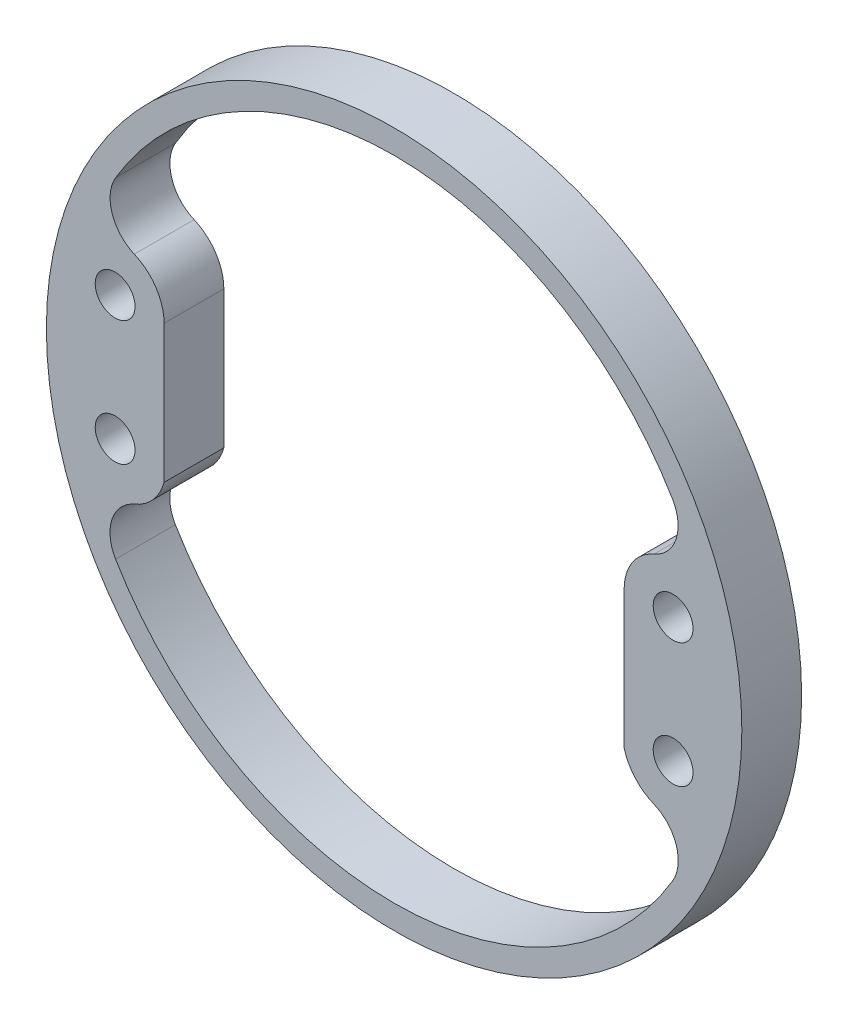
ISO-10303-21;
HEADER;
FILE_DESCRIPTION(('STEP AP214'),'2;1');
FILE_NAME('part.step','',(''),(''),'','','');
FILE_SCHEMA(('AUTOMOTIVE_DESIGN { 1 0 10303 214 1 1 1 1 }'));
ENDSEC;
DATA;
#1=APPLICATION_CONTEXT('core data for automotive mechanical design processes');
#2=APPLICATION_PROTOCOL_DEFINITION('international standard','automotive_design',2000,#1);
#3=PRODUCT_CONTEXT('',#1,'mechanical');
#4=PRODUCT('Part','Part','',(#3));
#5=PRODUCT_RELATED_PRODUCT_CATEGORY('part','',(#4));
#6=PRODUCT_DEFINITION_FORMATION('','',#4);
#7=PRODUCT_DEFINITION_CONTEXT('part definition',#1,'design');
#8=PRODUCT_DEFINITION('design','',#6,#7);
#9=PRODUCT_DEFINITION_SHAPE('','',#8);
#10=(LENGTH_UNIT() NAMED_UNIT(*) SI_UNIT(.MILLI.,.METRE.));
#11=(NAMED_UNIT(*) PLANE_ANGLE_UNIT() SI_UNIT($,.RADIAN.));
#12=(NAMED_UNIT(*) SI_UNIT($,.STERADIAN.) SOLID_ANGLE_UNIT());
#13=UNCERTAINTY_MEASURE_WITH_UNIT(LENGTH_MEASURE(1.E-05),#10,'distance_accuracy_value','');
#14=(GEOMETRIC_REPRESENTATION_CONTEXT(3) GLOBAL_UNCERTAINTY_ASSIGNED_CONTEXT((#13)) GLOBAL_UNIT_ASSIGNED_CONTEXT((#10,
#11,#12)) REPRESENTATION_CONTEXT('',''));
#15=CARTESIAN_POINT('',(0.,0.,0.));
#16=DIRECTION('',(0.,0.,1.));
#17=DIRECTION('',(1.,0.,0.));
#18=AXIS2_PLACEMENT_3D('',#15,#16,#17);
#19=CARTESIAN_POINT('',(0.,0.,3.81));
#20=DIRECTION('',(0.,0.,-1.));
#21=DIRECTION('',(-1.,0.,0.));
#22=AXIS2_PLACEMENT_3D('',#19,#20,#21);
#23=CYLINDRICAL_SURFACE('',#22,20.6375);
#24=CARTESIAN_POINT('',(0.,0.,3.81));
#25=DIRECTION('',(0.,0.,1.));
#26=DIRECTION('',(1.,0.,0.));
#27=AXIS2_PLACEMENT_3D('',#24,#25,#26);
#28=CIRCLE('',#27,20.6375);
#29=CARTESIAN_POINT('',(-17.7509733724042,-10.5266020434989,3.81));
#30=VERTEX_POINT('',#29);
#31=CARTESIAN_POINT('',(17.7509733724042,-10.5266020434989,3.81));
#32=VERTEX_POINT('',#31);
#33=EDGE_CURVE('E173',#30,#32,#28,.T.);
#34=ORIENTED_EDGE('',*,*,#33,.T.);
#35=DIRECTION('',(0.,0.,-1.));
#36=VECTOR('',#35,1.);
#37=CARTESIAN_POINT('',(17.7509733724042,-10.5266020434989,3.81));
#38=LINE('',#37,#36);
#39=CARTESIAN_POINT('',(17.7509733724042,-10.5266020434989,0.));
#40=VERTEX_POINT('',#39);
#41=EDGE_CURVE('E219',#32,#40,#38,.T.);
#42=ORIENTED_EDGE('',*,*,#41,.T.);
#43=CARTESIAN_POINT('',(0.,0.,0.));
#44=DIRECTION('',(0.,0.,1.));
#45=DIRECTION('',(1.,0.,0.));
#46=AXIS2_PLACEMENT_3D('',#43,#44,#45);
#47=CIRCLE('',#46,20.6375);
#48=CARTESIAN_POINT('',(-17.7509733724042,-10.5266020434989,0.));
#49=VERTEX_POINT('',#48);
#50=EDGE_CURVE('E129',#49,#40,#47,.T.);
#51=ORIENTED_EDGE('',*,*,#50,.F.);
#52=DIRECTION('',(0.,0.,-1.));
#53=VECTOR('',#52,1.);
#54=CARTESIAN_POINT('',(-17.7509733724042,-10.5266020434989,3.81));
#55=LINE('',#54,#53);
#56=EDGE_CURVE('E217',#49,#30,#55,.F.);
#57=ORIENTED_EDGE('',*,*,#56,.T.);
#58=EDGE_LOOP('',(#34,#42,#51,#57));
#59=FACE_BOUND('',#58,.T.);
#60=ADVANCED_FACE('F31',(#59),#23,.F.);
#61=CARTESIAN_POINT('',(-17.78,-3.90147909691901,3.81));
#62=DIRECTION('',(0.,0.,-1.));
#63=DIRECTION('',(-1.,0.,0.));
#64=AXIS2_PLACEMENT_3D('',#61,#62,#63);
#65=CYLINDRICAL_SURFACE('',#64,3.23102679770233);
#66=CARTESIAN_POINT('',(-17.78,-3.90147909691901,3.81));
#67=DIRECTION('',(0.,0.,1.));
#68=DIRECTION('',(1.,0.,0.));
#69=AXIS2_PLACEMENT_3D('',#66,#67,#68);
#70=CIRCLE('',#69,3.23102679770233);
#71=CARTESIAN_POINT('',(-16.5405803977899,-6.88533117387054,3.81));
#72=VERTEX_POINT('',#71);
#73=CARTESIAN_POINT('',(-14.6605823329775,-4.74336245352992,3.81));
#74=VERTEX_POINT('',#73);
#75=EDGE_CURVE('E176',#72,#74,#70,.T.);
#76=ORIENTED_EDGE('',*,*,#75,.F.);
#77=DIRECTION('',(0.,0.,-1.));
#78=VECTOR('',#77,1.);
#79=CARTESIAN_POINT('',(-16.5405803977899,-6.88533117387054,3.81));
#80=LINE('',#79,#78);
#81=CARTESIAN_POINT('',(-16.5405803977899,-6.88533117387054,0.));
#82=VERTEX_POINT('',#81);
#83=EDGE_CURVE('E126',#72,#82,#80,.T.);
#84=ORIENTED_EDGE('',*,*,#83,.T.);
#85=CARTESIAN_POINT('',(-17.78,-3.90147909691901,0.));
#86=DIRECTION('',(0.,0.,1.));
#87=DIRECTION('',(1.,0.,0.));
#88=AXIS2_PLACEMENT_3D('',#85,#86,#87);
#89=CIRCLE('',#88,3.23102679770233);
#90=CARTESIAN_POINT('',(-14.6605823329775,-4.74336245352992,0.));
#91=VERTEX_POINT('',#90);
#92=EDGE_CURVE('E119',#82,#91,#89,.T.);
#93=ORIENTED_EDGE('',*,*,#92,.T.);
#94=DIRECTION('',(0.,0.,-1.));
#95=VECTOR('',#94,1.);
#96=CARTESIAN_POINT('',(-14.6605823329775,-4.74336245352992,3.81));
#97=LINE('',#96,#95);
#98=EDGE_CURVE('E123',#74,#91,#97,.T.);
#99=ORIENTED_EDGE('',*,*,#98,.F.);
#100=EDGE_LOOP('',(#76,#84,#93,#99));
#101=FACE_BOUND('',#100,.T.);
#102=ADVANCED_FACE('F122',(#101),#65,.T.);
#103=CARTESIAN_POINT('',(-14.6605823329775,-48.8967213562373,3.81));
#104=DIRECTION('',(1.,0.,0.));
#105=DIRECTION('',(0.,1.,0.));
#106=AXIS2_PLACEMENT_3D('',#103,#104,#105);
#107=PLANE('',#106);
#108=DIRECTION('',(0.,-1.,0.));
#109=VECTOR('',#108,1.);
#110=CARTESIAN_POINT('',(-14.6605823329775,-48.8967213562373,0.));
#111=LINE('',#110,#109);
#112=CARTESIAN_POINT('',(-14.6605823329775,4.03602090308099,0.));
#113=VERTEX_POINT('',#112);
#114=EDGE_CURVE('E128',#113,#91,#111,.T.);
#115=ORIENTED_EDGE('',*,*,#114,.F.);
#116=DIRECTION('',(0.,0.,-1.));
#117=VECTOR('',#116,1.);
#118=CARTESIAN_POINT('',(-14.6605823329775,4.03602090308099,3.81));
#119=LINE('',#118,#117);
#120=CARTESIAN_POINT('',(-14.6605823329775,4.03602090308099,3.81));
#121=VERTEX_POINT('',#120);
#122=EDGE_CURVE('E138',#121,#113,#119,.T.);
#123=ORIENTED_EDGE('',*,*,#122,.F.);
#124=DIRECTION('',(0.,-1.,0.));
#125=VECTOR('',#124,1.);
#126=CARTESIAN_POINT('',(-14.6605823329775,-48.8967213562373,3.81));
#127=LINE('',#126,#125);
#128=EDGE_CURVE('E136',#121,#74,#127,.T.);
#129=ORIENTED_EDGE('',*,*,#128,.T.);
#130=ORIENTED_EDGE('',*,*,#98,.T.);
#131=EDGE_LOOP('',(#115,#123,#129,#130));
#132=FACE_BOUND('',#131,.T.);
#133=ADVANCED_FACE('F133',(#132),#107,.T.);
#134=CARTESIAN_POINT('',(-17.78,4.03602090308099,3.81));
#135=DIRECTION('',(0.,0.,-1.));
#136=DIRECTION('',(-1.,0.,0.));
#137=AXIS2_PLACEMENT_3D('',#134,#135,#136);
#138=CYLINDRICAL_SURFACE('',#137,3.1194176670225);
#139=CARTESIAN_POINT('',(-17.78,4.03602090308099,0.));
#140=DIRECTION('',(0.,0.,1.));
#141=DIRECTION('',(1.,0.,0.));
#142=AXIS2_PLACEMENT_3D('',#139,#140,#141);
#143=CIRCLE('',#142,3.1194176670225);
#144=CARTESIAN_POINT('',(-16.5562749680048,6.90538731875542,0.));
#145=VERTEX_POINT('',#144);
#146=EDGE_CURVE('E142',#145,#113,#143,.F.);
#147=ORIENTED_EDGE('',*,*,#146,.F.);
#148=DIRECTION('',(0.,0.,-1.));
#149=VECTOR('',#148,1.);
#150=CARTESIAN_POINT('',(-16.5562749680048,6.90538731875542,3.81));
#151=LINE('',#150,#149);
#152=CARTESIAN_POINT('',(-16.5562749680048,6.90538731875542,3.81));
#153=VERTEX_POINT('',#152);
#154=EDGE_CURVE('E46',#145,#153,#151,.F.);
#155=ORIENTED_EDGE('',*,*,#154,.T.);
#156=CARTESIAN_POINT('',(-17.78,4.03602090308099,3.81));
#157=DIRECTION('',(0.,0.,1.));
#158=DIRECTION('',(1.,0.,0.));
#159=AXIS2_PLACEMENT_3D('',#156,#157,#158);
#160=CIRCLE('',#159,3.1194176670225);
#161=EDGE_CURVE('E179',#153,#121,#160,.F.);
#162=ORIENTED_EDGE('',*,*,#161,.T.);
#163=ORIENTED_EDGE('',*,*,#122,.T.);
#164=EDGE_LOOP('',(#147,#155,#162,#163));
#165=FACE_BOUND('',#164,.T.);
#166=ADVANCED_FACE('F276',(#165),#138,.T.);
#167=CARTESIAN_POINT('',(0.,0.,3.81));
#168=DIRECTION('',(0.,0.,-1.));
#169=DIRECTION('',(-1.,0.,0.));
#170=AXIS2_PLACEMENT_3D('',#167,#168,#169);
#171=CYLINDRICAL_SURFACE('',#170,20.6375);
#172=CARTESIAN_POINT('',(0.,0.,0.));
#173=DIRECTION('',(0.,0.,1.));
#174=DIRECTION('',(1.,0.,0.));
#175=AXIS2_PLACEMENT_3D('',#172,#173,#174);
#176=CIRCLE('',#175,20.6375);
#177=CARTESIAN_POINT('',(-17.7436900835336,10.538874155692,0.));
#178=VERTEX_POINT('',#177);
#179=CARTESIAN_POINT('',(17.7436900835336,10.538874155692,0.));
#180=VERTEX_POINT('',#179);
#181=EDGE_CURVE('E145',#178,#180,#176,.F.);
#182=ORIENTED_EDGE('',*,*,#181,.T.);
#183=DIRECTION('',(0.,0.,-1.));
#184=VECTOR('',#183,1.);
#185=CARTESIAN_POINT('',(17.7436900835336,10.538874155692,3.81));
#186=LINE('',#185,#184);
#187=CARTESIAN_POINT('',(17.7436900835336,10.538874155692,3.81));
#188=VERTEX_POINT('',#187);
#189=EDGE_CURVE('E215',#180,#188,#186,.F.);
#190=ORIENTED_EDGE('',*,*,#189,.T.);
#191=CARTESIAN_POINT('',(0.,0.,3.81));
#192=DIRECTION('',(0.,0.,1.));
#193=DIRECTION('',(1.,0.,0.));
#194=AXIS2_PLACEMENT_3D('',#191,#192,#193);
#195=CIRCLE('',#194,20.6375);
#196=CARTESIAN_POINT('',(-17.7436900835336,10.538874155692,3.81));
#197=VERTEX_POINT('',#196);
#198=EDGE_CURVE('E181',#197,#188,#195,.F.);
#199=ORIENTED_EDGE('',*,*,#198,.F.);
#200=DIRECTION('',(0.,0.,-1.));
#201=VECTOR('',#200,1.);
#202=CARTESIAN_POINT('',(-17.7436900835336,10.538874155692,3.81));
#203=LINE('',#202,#201);
#204=EDGE_CURVE('E212',#197,#178,#203,.T.);
#205=ORIENTED_EDGE('',*,*,#204,.T.);
#206=EDGE_LOOP('',(#182,#190,#199,#205));
#207=FACE_BOUND('',#206,.T.);
#208=ADVANCED_FACE('F279',(#207),#171,.F.);
#209=CARTESIAN_POINT('',(17.78,4.03602090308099,3.81));
#210=DIRECTION('',(0.,0.,-1.));
#211=DIRECTION('',(-1.,0.,0.));
#212=AXIS2_PLACEMENT_3D('',#209,#210,#211);
#213=CYLINDRICAL_SURFACE('',#212,3.1194176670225);
#214=CARTESIAN_POINT('',(17.78,4.03602090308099,3.81));
#215=DIRECTION('',(0.,0.,1.));
#216=DIRECTION('',(1.,0.,0.));
#217=AXIS2_PLACEMENT_3D('',#214,#215,#216);
#218=CIRCLE('',#217,3.1194176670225);
#219=CARTESIAN_POINT('',(16.5562749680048,6.90538731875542,3.81));
#220=VERTEX_POINT('',#219);
#221=CARTESIAN_POINT('',(14.6605823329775,4.03602090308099,3.81));
#222=VERTEX_POINT('',#221);
#223=EDGE_CURVE('E184',#220,#222,#218,.T.);
#224=ORIENTED_EDGE('',*,*,#223,.F.);
#225=DIRECTION('',(0.,0.,-1.));
#226=VECTOR('',#225,1.);
#227=CARTESIAN_POINT('',(16.5562749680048,6.90538731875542,3.81));
#228=LINE('',#227,#226);
#229=CARTESIAN_POINT('',(16.5562749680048,6.90538731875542,0.));
#230=VERTEX_POINT('',#229);
#231=EDGE_CURVE('E137',#220,#230,#228,.T.);
#232=ORIENTED_EDGE('',*,*,#231,.T.);
#233=CARTESIAN_POINT('',(17.78,4.03602090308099,0.));
#234=DIRECTION('',(0.,0.,1.));
#235=DIRECTION('',(1.,0.,0.));
#236=AXIS2_PLACEMENT_3D('',#233,#234,#235);
#237=CIRCLE('',#236,3.1194176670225);
#238=CARTESIAN_POINT('',(14.6605823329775,4.03602090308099,0.));
#239=VERTEX_POINT('',#238);
#240=EDGE_CURVE('E151',#230,#239,#237,.T.);
#241=ORIENTED_EDGE('',*,*,#240,.T.);
#242=DIRECTION('',(0.,0.,-1.));
#243=VECTOR('',#242,1.);
#244=CARTESIAN_POINT('',(14.6605823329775,4.03602090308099,3.81));
#245=LINE('',#244,#243);
#246=EDGE_CURVE('E206',#222,#239,#245,.T.);
#247=ORIENTED_EDGE('',*,*,#246,.F.);
#248=EDGE_LOOP('',(#224,#232,#241,#247));
#249=FACE_BOUND('',#248,.T.);
#250=ADVANCED_FACE('F282',(#249),#213,.T.);
#251=CARTESIAN_POINT('',(14.6605823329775,-48.8967213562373,3.81));
#252=DIRECTION('',(1.,0.,0.));
#253=DIRECTION('',(0.,0.,-1.));
#254=AXIS2_PLACEMENT_3D('',#251,#252,#253);
#255=PLANE('',#254);
#256=DIRECTION('',(0.,-1.,0.));
#257=VECTOR('',#256,1.);
#258=CARTESIAN_POINT('',(14.6605823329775,-48.8967213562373,0.));
#259=LINE('',#258,#257);
#260=CARTESIAN_POINT('',(14.6605823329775,-4.74336245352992,0.));
#261=VERTEX_POINT('',#260);
#262=EDGE_CURVE('E153',#239,#261,#259,.T.);
#263=ORIENTED_EDGE('',*,*,#262,.T.);
#264=DIRECTION('',(0.,0.,-1.));
#265=VECTOR('',#264,1.);
#266=CARTESIAN_POINT('',(14.6605823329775,-4.74336245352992,3.81));
#267=LINE('',#266,#265);
#268=CARTESIAN_POINT('',(14.6605823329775,-4.74336245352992,3.81));
#269=VERTEX_POINT('',#268);
#270=EDGE_CURVE('E203',#269,#261,#267,.T.);
#271=ORIENTED_EDGE('',*,*,#270,.F.);
#272=DIRECTION('',(0.,-1.,0.));
#273=VECTOR('',#272,1.);
#274=CARTESIAN_POINT('',(14.6605823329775,-48.8967213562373,3.81));
#275=LINE('',#274,#273);
#276=EDGE_CURVE('E186',#222,#269,#275,.T.);
#277=ORIENTED_EDGE('',*,*,#276,.F.);
#278=ORIENTED_EDGE('',*,*,#246,.T.);
#279=EDGE_LOOP('',(#263,#271,#277,#278));
#280=FACE_BOUND('',#279,.T.);
#281=ADVANCED_FACE('F286',(#280),#255,.F.);
#282=CARTESIAN_POINT('',(0.,0.,3.81));
#283=DIRECTION('',(0.,0.,-1.));
#284=DIRECTION('',(-1.,0.,0.));
#285=AXIS2_PLACEMENT_3D('',#282,#283,#284);
#286=CYLINDRICAL_SURFACE('',#285,22.1615);
#287=CARTESIAN_POINT('',(0.,0.,3.81));
#288=DIRECTION('',(0.,0.,1.));
#289=DIRECTION('',(1.,0.,0.));
#290=AXIS2_PLACEMENT_3D('',#287,#288,#289);
#291=CIRCLE('',#290,22.1615);
#292=CARTESIAN_POINT('',(-22.1615,0.,3.81));
#293=VERTEX_POINT('',#292);
#294=EDGE_CURVE('E197',#293,#293,#291,.T.);
#295=CARTESIAN_POINT('',(0.,0.,0.));
#296=DIRECTION('',(0.,0.,1.));
#297=DIRECTION('',(1.,0.,0.));
#298=AXIS2_PLACEMENT_3D('',#295,#296,#297);
#299=CIRCLE('',#298,22.1615);
#300=CARTESIAN_POINT('',(-22.1615,0.,0.));
#301=VERTEX_POINT('',#300);
#302=EDGE_CURVE('E164',#301,#301,#299,.T.);
#303=CARTESIAN_POINT('',(-22.1615,0.,3.81));
#304=CARTESIAN_POINT('',(-22.1615,0.,3.7703125));
#305=CARTESIAN_POINT('',(-22.1615,0.,3.730625));
#306=CARTESIAN_POINT('',(-22.1615,0.,3.65125));
#307=CARTESIAN_POINT('',(-22.1615,0.,3.6115625));
#308=CARTESIAN_POINT('',(-22.1615,0.,3.5321875));
#309=CARTESIAN_POINT('',(-22.1615,0.,3.4925));
#310=CARTESIAN_POINT('',(-22.1615,0.,3.413125));
#311=CARTESIAN_POINT('',(-22.1615,0.,3.3734375));
#312=CARTESIAN_POINT('',(-22.1615,0.,3.2940625));
#313=CARTESIAN_POINT('',(-22.1615,0.,3.254375));
#314=CARTESIAN_POINT('',(-22.1615,0.,3.175));
#315=CARTESIAN_POINT('',(-22.1615,0.,3.1353125));
#316=CARTESIAN_POINT('',(-22.1615,0.,3.0559375));
#317=CARTESIAN_POINT('',(-22.1615,0.,3.01625));
#318=CARTESIAN_POINT('',(-22.1615,0.,2.936875));
#319=CARTESIAN_POINT('',(-22.1615,0.,2.8971875));
#320=CARTESIAN_POINT('',(-22.1615,0.,2.8178125));
#321=CARTESIAN_POINT('',(-22.1615,0.,2.778125));
#322=CARTESIAN_POINT('',(-22.1615,0.,2.69875));
#323=CARTESIAN_POINT('',(-22.1615,0.,2.6590625));
#324=CARTESIAN_POINT('',(-22.1615,0.,2.5796875));
#325=CARTESIAN_POINT('',(-22.1615,0.,2.54));
#326=CARTESIAN_POINT('',(-22.1615,0.,2.460625));
#327=CARTESIAN_POINT('',(-22.1615,0.,2.4209375));
#328=CARTESIAN_POINT('',(-22.1615,0.,2.3415625));
#329=CARTESIAN_POINT('',(-22.1615,0.,2.301875));
#330=CARTESIAN_POINT('',(-22.1615,0.,2.2225));
#331=CARTESIAN_POINT('',(-22.1615,0.,2.1828125));
#332=CARTESIAN_POINT('',(-22.1615,0.,2.1034375));
#333=CARTESIAN_POINT('',(-22.1615,0.,2.06375));
#334=CARTESIAN_POINT('',(-22.1615,0.,1.984375));
#335=CARTESIAN_POINT('',(-22.1615,0.,1.9446875));
#336=CARTESIAN_POINT('',(-22.1615,0.,1.8653125));
#337=CARTESIAN_POINT('',(-22.1615,0.,1.825625));
#338=CARTESIAN_POINT('',(-22.1615,0.,1.74625));
#339=CARTESIAN_POINT('',(-22.1615,0.,1.7065625));
#340=CARTESIAN_POINT('',(-22.1615,0.,1.6271875));
#341=CARTESIAN_POINT('',(-22.1615,0.,1.5875));
#342=CARTESIAN_POINT('',(-22.1615,0.,1.508125));
#343=CARTESIAN_POINT('',(-22.1615,0.,1.4684375));
#344=CARTESIAN_POINT('',(-22.1615,0.,1.3890625));
#345=CARTESIAN_POINT('',(-22.1615,0.,1.349375));
#346=CARTESIAN_POINT('',(-22.1615,0.,1.27));
#347=CARTESIAN_POINT('',(-22.1615,0.,1.2303125));
#348=CARTESIAN_POINT('',(-22.1615,0.,1.1509375));
#349=CARTESIAN_POINT('',(-22.1615,0.,1.11125));
#350=CARTESIAN_POINT('',(-22.1615,0.,1.031875));
#351=CARTESIAN_POINT('',(-22.1615,0.,0.9921875));
#352=CARTESIAN_POINT('',(-22.1615,0.,0.9128125));
#353=CARTESIAN_POINT('',(-22.1615,0.,0.873125));
#354=CARTESIAN_POINT('',(-22.1615,0.,0.79375));
#355=CARTESIAN_POINT('',(-22.1615,0.,0.7540625));
#356=CARTESIAN_POINT('',(-22.1615,0.,0.6746875));
#357=CARTESIAN_POINT('',(-22.1615,0.,0.635));
#358=CARTESIAN_POINT('',(-22.1615,0.,0.555625));
#359=CARTESIAN_POINT('',(-22.1615,0.,0.5159375));
#360=CARTESIAN_POINT('',(-22.1615,0.,0.4365625));
#361=CARTESIAN_POINT('',(-22.1615,0.,0.396875));
#362=CARTESIAN_POINT('',(-22.1615,0.,0.3175));
#363=CARTESIAN_POINT('',(-22.1615,0.,0.2778125));
#364=CARTESIAN_POINT('',(-22.1615,0.,0.1984375));
#365=CARTESIAN_POINT('',(-22.1615,0.,0.15875));
#366=CARTESIAN_POINT('',(-22.1615,0.,0.0793749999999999));
#367=CARTESIAN_POINT('',(-22.1615,0.,0.0396874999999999));
#368=CARTESIAN_POINT('',(-22.1615,0.,0.));
#369=B_SPLINE_CURVE_WITH_KNOTS('',3,(#303,#304,#305,#306,#307,#308,#309,#310,#311,#312,#313,
#314,#315,#316,#317,#318,#319,#320,#321,#322,#323,#324,#325,#326,#327,#328,#329,#330,#331,#332,
#333,#334,#335,#336,#337,#338,#339,#340,#341,#342,#343,#344,#345,#346,#347,#348,#349,#350,#351,
#352,#353,#354,#355,#356,#357,#358,#359,#360,#361,#362,#363,#364,#365,#366,#367,#368),
.UNSPECIFIED.,.F.,.F.,(4,2,2,2,2,2,2,2,2,2,2,2,2,2,2,2,2,2,2,2,2,2,2,2,2,2,2,2,2,2,2,2,4),(0.,
0.1190625,0.238125,0.3571875,0.47625,0.5953125,0.714375,0.8334375,0.9525,1.0715625,1.190625,
1.3096875,1.42875,1.5478125,1.666875,1.7859375,1.905,2.0240625,2.143125,2.2621875,2.38125,
2.5003125,2.619375,2.7384375,2.8575,2.9765625,3.095625,3.2146875,3.33375,3.4528125,3.571875,
3.6909375,3.81),.UNSPECIFIED.);
#370=EDGE_CURVE('BSEAM290',#293,#301,#369,.T.);
#371=ORIENTED_EDGE('',*,*,#294,.F.);
#372=ORIENTED_EDGE('',*,*,#302,.T.);
#373=ORIENTED_EDGE('',*,*,#370,.T.);
#374=ORIENTED_EDGE('',*,*,#370,.F.);
#375=EDGE_LOOP('',(#371,#373,#372,#374));
#376=FACE_BOUND('',#375,.T.);
#377=ADVANCED_FACE('F290',(#376),#286,.T.);
#378=CARTESIAN_POINT('',(-17.78,4.03602090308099,3.81));
#379=DIRECTION('',(0.,0.,-1.));
#380=DIRECTION('',(-1.,0.,0.));
#381=AXIS2_PLACEMENT_3D('',#378,#379,#380);
#382=CYLINDRICAL_SURFACE('',#381,1.27);
#383=CARTESIAN_POINT('',(-17.78,4.03602090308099,3.81));
#384=DIRECTION('',(0.,0.,1.));
#385=DIRECTION('',(1.,0.,0.));
#386=AXIS2_PLACEMENT_3D('',#383,#384,#385);
#387=CIRCLE('',#386,1.27);
#388=CARTESIAN_POINT('',(-19.05,4.03602090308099,3.81));
#389=VERTEX_POINT('',#388);
#390=EDGE_CURVE('E194',#389,#389,#387,.T.);
#391=CARTESIAN_POINT('',(-17.78,4.03602090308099,0.));
#392=DIRECTION('',(0.,0.,1.));
#393=DIRECTION('',(1.,0.,0.));
#394=AXIS2_PLACEMENT_3D('',#391,#392,#393);
#395=CIRCLE('',#394,1.27);
#396=CARTESIAN_POINT('',(-19.05,4.03602090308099,0.));
#397=VERTEX_POINT('',#396);
#398=EDGE_CURVE('E161',#397,#397,#395,.T.);
#399=CARTESIAN_POINT('',(-19.05,4.03602090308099,3.81));
#400=CARTESIAN_POINT('',(-19.05,4.03602090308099,3.7703125));
#401=CARTESIAN_POINT('',(-19.05,4.03602090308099,3.730625));
#402=CARTESIAN_POINT('',(-19.05,4.03602090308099,3.65125));
#403=CARTESIAN_POINT('',(-19.05,4.03602090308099,3.6115625));
#404=CARTESIAN_POINT('',(-19.05,4.03602090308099,3.5321875));
#405=CARTESIAN_POINT('',(-19.05,4.03602090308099,3.4925));
#406=CARTESIAN_POINT('',(-19.05,4.03602090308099,3.413125));
#407=CARTESIAN_POINT('',(-19.05,4.03602090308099,3.3734375));
#408=CARTESIAN_POINT('',(-19.05,4.03602090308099,3.2940625));
#409=CARTESIAN_POINT('',(-19.05,4.03602090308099,3.254375));
#410=CARTESIAN_POINT('',(-19.05,4.03602090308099,3.175));
#411=CARTESIAN_POINT('',(-19.05,4.03602090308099,3.1353125));
#412=CARTESIAN_POINT('',(-19.05,4.03602090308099,3.0559375));
#413=CARTESIAN_POINT('',(-19.05,4.03602090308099,3.01625));
#414=CARTESIAN_POINT('',(-19.05,4.03602090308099,2.936875));
#415=CARTESIAN_POINT('',(-19.05,4.03602090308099,2.8971875));
#416=CARTESIAN_POINT('',(-19.05,4.03602090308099,2.8178125));
#417=CARTESIAN_POINT('',(-19.05,4.03602090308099,2.778125));
#418=CARTESIAN_POINT('',(-19.05,4.03602090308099,2.69875));
#419=CARTESIAN_POINT('',(-19.05,4.03602090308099,2.6590625));
#420=CARTESIAN_POINT('',(-19.05,4.03602090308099,2.5796875));
#421=CARTESIAN_POINT('',(-19.05,4.03602090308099,2.54));
#422=CARTESIAN_POINT('',(-19.05,4.03602090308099,2.460625));
#423=CARTESIAN_POINT('',(-19.05,4.03602090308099,2.4209375));
#424=CARTESIAN_POINT('',(-19.05,4.03602090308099,2.3415625));
#425=CARTESIAN_POINT('',(-19.05,4.03602090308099,2.301875));
#426=CARTESIAN_POINT('',(-19.05,4.03602090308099,2.2225));
#427=CARTESIAN_POINT('',(-19.05,4.03602090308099,2.1828125));
#428=CARTESIAN_POINT('',(-19.05,4.03602090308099,2.1034375));
#429=CARTESIAN_POINT('',(-19.05,4.03602090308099,2.06375));
#430=CARTESIAN_POINT('',(-19.05,4.03602090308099,1.984375));
#431=CARTESIAN_POINT('',(-19.05,4.03602090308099,1.9446875));
#432=CARTESIAN_POINT('',(-19.05,4.03602090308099,1.8653125));
#433=CARTESIAN_POINT('',(-19.05,4.03602090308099,1.825625));
#434=CARTESIAN_POINT('',(-19.05,4.03602090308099,1.74625));
#435=CARTESIAN_POINT('',(-19.05,4.03602090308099,1.7065625));
#436=CARTESIAN_POINT('',(-19.05,4.03602090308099,1.6271875));
#437=CARTESIAN_POINT('',(-19.05,4.03602090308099,1.5875));
#438=CARTESIAN_POINT('',(-19.05,4.03602090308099,1.508125));
#439=CARTESIAN_POINT('',(-19.05,4.03602090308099,1.4684375));
#440=CARTESIAN_POINT('',(-19.05,4.03602090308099,1.3890625));
#441=CARTESIAN_POINT('',(-19.05,4.03602090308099,1.349375));
#442=CARTESIAN_POINT('',(-19.05,4.03602090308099,1.27));
#443=CARTESIAN_POINT('',(-19.05,4.03602090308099,1.2303125));
#444=CARTESIAN_POINT('',(-19.05,4.03602090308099,1.1509375));
#445=CARTESIAN_POINT('',(-19.05,4.03602090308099,1.11125));
#446=CARTESIAN_POINT('',(-19.05,4.03602090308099,1.031875));
#447=CARTESIAN_POINT('',(-19.05,4.03602090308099,0.9921875));
#448=CARTESIAN_POINT('',(-19.05,4.03602090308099,0.9128125));
#449=CARTESIAN_POINT('',(-19.05,4.03602090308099,0.873125));
#450=CARTESIAN_POINT('',(-19.05,4.03602090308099,0.79375));
#451=CARTESIAN_POINT('',(-19.05,4.03602090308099,0.7540625));
#452=CARTESIAN_POINT('',(-19.05,4.03602090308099,0.6746875));
#453=CARTESIAN_POINT('',(-19.05,4.03602090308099,0.635));
#454=CARTESIAN_POINT('',(-19.05,4.03602090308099,0.555625));
#455=CARTESIAN_POINT('',(-19.05,4.03602090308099,0.5159375));
#456=CARTESIAN_POINT('',(-19.05,4.03602090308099,0.4365625));
#457=CARTESIAN_POINT('',(-19.05,4.03602090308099,0.396875));
#458=CARTESIAN_POINT('',(-19.05,4.03602090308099,0.3175));
#459=CARTESIAN_POINT('',(-19.05,4.03602090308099,0.2778125));
#460=CARTESIAN_POINT('',(-19.05,4.03602090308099,0.1984375));
#461=CARTESIAN_POINT('',(-19.05,4.03602090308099,0.15875));
#462=CARTESIAN_POINT('',(-19.05,4.03602090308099,0.0793749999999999));
#463=CARTESIAN_POINT('',(-19.05,4.03602090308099,0.0396874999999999));
#464=CARTESIAN_POINT('',(-19.05,4.03602090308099,0.));
#465=B_SPLINE_CURVE_WITH_KNOTS('',3,(#399,#400,#401,#402,#403,#404,#405,#406,#407,#408,#409,
#410,#411,#412,#413,#414,#415,#416,#417,#418,#419,#420,#421,#422,#423,#424,#425,#426,#427,#428,
#429,#430,#431,#432,#433,#434,#435,#436,#437,#438,#439,#440,#441,#442,#443,#444,#445,#446,#447,
#448,#449,#450,#451,#452,#453,#454,#455,#456,#457,#458,#459,#460,#461,#462,#463,#464),
.UNSPECIFIED.,.F.,.F.,(4,2,2,2,2,2,2,2,2,2,2,2,2,2,2,2,2,2,2,2,2,2,2,2,2,2,2,2,2,2,2,2,4),(0.,
0.1190625,0.238125,0.3571875,0.47625,0.5953125,0.714375,0.8334375,0.9525,1.0715625,1.190625,
1.3096875,1.42875,1.5478125,1.666875,1.7859375,1.905,2.0240625,2.143125,2.2621875,2.38125,
2.5003125,2.619375,2.7384375,2.8575,2.9765625,3.095625,3.2146875,3.33375,3.4528125,3.571875,
3.6909375,3.81),.UNSPECIFIED.);
#466=EDGE_CURVE('BSEAM299',#389,#397,#465,.T.);
#467=ORIENTED_EDGE('',*,*,#390,.T.);
#468=ORIENTED_EDGE('',*,*,#398,.F.);
#469=ORIENTED_EDGE('',*,*,#466,.T.);
#470=ORIENTED_EDGE('',*,*,#466,.F.);
#471=EDGE_LOOP('',(#467,#469,#468,#470));
#472=FACE_BOUND('',#471,.T.);
#473=ADVANCED_FACE('F299',(#472),#382,.F.);
#474=CARTESIAN_POINT('',(17.78,4.03602090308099,3.81));
#475=DIRECTION('',(0.,0.,-1.));
#476=DIRECTION('',(-1.,0.,0.));
#477=AXIS2_PLACEMENT_3D('',#474,#475,#476);
#478=CYLINDRICAL_SURFACE('',#477,1.27);
#479=CARTESIAN_POINT('',(17.78,4.03602090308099,3.81));
#480=DIRECTION('',(0.,0.,1.));
#481=DIRECTION('',(1.,0.,0.));
#482=AXIS2_PLACEMENT_3D('',#479,#480,#481);
#483=CIRCLE('',#482,1.27);
#484=CARTESIAN_POINT('',(16.51,4.03602090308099,3.81));
#485=VERTEX_POINT('',#484);
#486=EDGE_CURVE('E191',#485,#485,#483,.T.);
#487=CARTESIAN_POINT('',(17.78,4.03602090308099,0.));
#488=DIRECTION('',(0.,0.,1.));
#489=DIRECTION('',(1.,0.,0.));
#490=AXIS2_PLACEMENT_3D('',#487,#488,#489);
#491=CIRCLE('',#490,1.27);
#492=CARTESIAN_POINT('',(16.51,4.03602090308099,0.));
#493=VERTEX_POINT('',#492);
#494=EDGE_CURVE('E158',#493,#493,#491,.T.);
#495=CARTESIAN_POINT('',(16.51,4.03602090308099,3.81));
#496=CARTESIAN_POINT('',(16.51,4.03602090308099,3.7703125));
#497=CARTESIAN_POINT('',(16.51,4.03602090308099,3.730625));
#498=CARTESIAN_POINT('',(16.51,4.03602090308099,3.65125));
#499=CARTESIAN_POINT('',(16.51,4.03602090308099,3.6115625));
#500=CARTESIAN_POINT('',(16.51,4.03602090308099,3.5321875));
#501=CARTESIAN_POINT('',(16.51,4.03602090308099,3.4925));
#502=CARTESIAN_POINT('',(16.51,4.03602090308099,3.413125));
#503=CARTESIAN_POINT('',(16.51,4.03602090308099,3.3734375));
#504=CARTESIAN_POINT('',(16.51,4.03602090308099,3.2940625));
#505=CARTESIAN_POINT('',(16.51,4.03602090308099,3.254375));
#506=CARTESIAN_POINT('',(16.51,4.03602090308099,3.175));
#507=CARTESIAN_POINT('',(16.51,4.03602090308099,3.1353125));
#508=CARTESIAN_POINT('',(16.51,4.03602090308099,3.0559375));
#509=CARTESIAN_POINT('',(16.51,4.03602090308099,3.01625));
#510=CARTESIAN_POINT('',(16.51,4.03602090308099,2.936875));
#511=CARTESIAN_POINT('',(16.51,4.03602090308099,2.8971875));
#512=CARTESIAN_POINT('',(16.51,4.03602090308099,2.8178125));
#513=CARTESIAN_POINT('',(16.51,4.03602090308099,2.778125));
#514=CARTESIAN_POINT('',(16.51,4.03602090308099,2.69875));
#515=CARTESIAN_POINT('',(16.51,4.03602090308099,2.6590625));
#516=CARTESIAN_POINT('',(16.51,4.03602090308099,2.5796875));
#517=CARTESIAN_POINT('',(16.51,4.03602090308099,2.54));
#518=CARTESIAN_POINT('',(16.51,4.03602090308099,2.460625));
#519=CARTESIAN_POINT('',(16.51,4.03602090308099,2.4209375));
#520=CARTESIAN_POINT('',(16.51,4.03602090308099,2.3415625));
#521=CARTESIAN_POINT('',(16.51,4.03602090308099,2.301875));
#522=CARTESIAN_POINT('',(16.51,4.03602090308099,2.2225));
#523=CARTESIAN_POINT('',(16.51,4.03602090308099,2.1828125));
#524=CARTESIAN_POINT('',(16.51,4.03602090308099,2.1034375));
#525=CARTESIAN_POINT('',(16.51,4.03602090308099,2.06375));
#526=CARTESIAN_POINT('',(16.51,4.03602090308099,1.984375));
#527=CARTESIAN_POINT('',(16.51,4.03602090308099,1.9446875));
#528=CARTESIAN_POINT('',(16.51,4.03602090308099,1.8653125));
#529=CARTESIAN_POINT('',(16.51,4.03602090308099,1.825625));
#530=CARTESIAN_POINT('',(16.51,4.03602090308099,1.74625));
#531=CARTESIAN_POINT('',(16.51,4.03602090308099,1.7065625));
#532=CARTESIAN_POINT('',(16.51,4.03602090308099,1.6271875));
#533=CARTESIAN_POINT('',(16.51,4.03602090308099,1.5875));
#534=CARTESIAN_POINT('',(16.51,4.03602090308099,1.508125));
#535=CARTESIAN_POINT('',(16.51,4.03602090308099,1.4684375));
#536=CARTESIAN_POINT('',(16.51,4.03602090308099,1.3890625));
#537=CARTESIAN_POINT('',(16.51,4.03602090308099,1.349375));
#538=CARTESIAN_POINT('',(16.51,4.03602090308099,1.27));
#539=CARTESIAN_POINT('',(16.51,4.03602090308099,1.2303125));
#540=CARTESIAN_POINT('',(16.51,4.03602090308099,1.1509375));
#541=CARTESIAN_POINT('',(16.51,4.03602090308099,1.11125));
#542=CARTESIAN_POINT('',(16.51,4.03602090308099,1.031875));
#543=CARTESIAN_POINT('',(16.51,4.03602090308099,0.9921875));
#544=CARTESIAN_POINT('',(16.51,4.03602090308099,0.9128125));
#545=CARTESIAN_POINT('',(16.51,4.03602090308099,0.873125));
#546=CARTESIAN_POINT('',(16.51,4.03602090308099,0.79375));
#547=CARTESIAN_POINT('',(16.51,4.03602090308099,0.7540625));
#548=CARTESIAN_POINT('',(16.51,4.03602090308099,0.6746875));
#549=CARTESIAN_POINT('',(16.51,4.03602090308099,0.635));
#550=CARTESIAN_POINT('',(16.51,4.03602090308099,0.555625));
#551=CARTESIAN_POINT('',(16.51,4.03602090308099,0.5159375));
#552=CARTESIAN_POINT('',(16.51,4.03602090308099,0.4365625));
#553=CARTESIAN_POINT('',(16.51,4.03602090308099,0.396875));
#554=CARTESIAN_POINT('',(16.51,4.03602090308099,0.3175));
#555=CARTESIAN_POINT('',(16.51,4.03602090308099,0.2778125));
#556=CARTESIAN_POINT('',(16.51,4.03602090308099,0.1984375));
#557=CARTESIAN_POINT('',(16.51,4.03602090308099,0.15875));
#558=CARTESIAN_POINT('',(16.51,4.03602090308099,0.0793749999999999));
#559=CARTESIAN_POINT('',(16.51,4.03602090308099,0.0396874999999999));
#560=CARTESIAN_POINT('',(16.51,4.03602090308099,0.));
#561=B_SPLINE_CURVE_WITH_KNOTS('',3,(#495,#496,#497,#498,#499,#500,#501,#502,#503,#504,#505,
#506,#507,#508,#509,#510,#511,#512,#513,#514,#515,#516,#517,#518,#519,#520,#521,#522,#523,#524,
#525,#526,#527,#528,#529,#530,#531,#532,#533,#534,#535,#536,#537,#538,#539,#540,#541,#542,#543,
#544,#545,#546,#547,#548,#549,#550,#551,#552,#553,#554,#555,#556,#557,#558,#559,#560),
.UNSPECIFIED.,.F.,.F.,(4,2,2,2,2,2,2,2,2,2,2,2,2,2,2,2,2,2,2,2,2,2,2,2,2,2,2,2,2,2,2,2,4),(0.,
0.1190625,0.238125,0.3571875,0.47625,0.5953125,0.714375,0.8334375,0.9525,1.0715625,1.190625,
1.3096875,1.42875,1.5478125,1.666875,1.7859375,1.905,2.0240625,2.143125,2.2621875,2.38125,
2.5003125,2.619375,2.7384375,2.8575,2.9765625,3.095625,3.2146875,3.33375,3.4528125,3.571875,
3.6909375,3.81),.UNSPECIFIED.);
#562=EDGE_CURVE('BSEAM295',#485,#493,#561,.T.);
#563=ORIENTED_EDGE('',*,*,#486,.T.);
#564=ORIENTED_EDGE('',*,*,#494,.F.);
#565=ORIENTED_EDGE('',*,*,#562,.T.);
#566=ORIENTED_EDGE('',*,*,#562,.F.);
#567=EDGE_LOOP('',(#563,#565,#564,#566));
#568=FACE_BOUND('',#567,.T.);
#569=ADVANCED_FACE('F295',(#568),#478,.F.);
#570=CARTESIAN_POINT('',(17.78,-3.90147909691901,3.81));
#571=DIRECTION('',(0.,0.,-1.));
#572=DIRECTION('',(-1.,0.,0.));
#573=AXIS2_PLACEMENT_3D('',#570,#571,#572);
#574=CYLINDRICAL_SURFACE('',#573,3.23102679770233);
#575=CARTESIAN_POINT('',(17.78,-3.90147909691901,0.));
#576=DIRECTION('',(0.,0.,1.));
#577=DIRECTION('',(1.,0.,0.));
#578=AXIS2_PLACEMENT_3D('',#575,#576,#577);
#579=CIRCLE('',#578,3.23102679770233);
#580=CARTESIAN_POINT('',(16.5405803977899,-6.88533117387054,0.));
#581=VERTEX_POINT('',#580);
#582=EDGE_CURVE('E156',#581,#261,#579,.F.);
#583=ORIENTED_EDGE('',*,*,#582,.F.);
#584=DIRECTION('',(0.,0.,-1.));
#585=VECTOR('',#584,1.);
#586=CARTESIAN_POINT('',(16.5405803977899,-6.88533117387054,3.81));
#587=LINE('',#586,#585);
#588=CARTESIAN_POINT('',(16.5405803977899,-6.88533117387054,3.81));
#589=VERTEX_POINT('',#588);
#590=EDGE_CURVE('E222',#581,#589,#587,.F.);
#591=ORIENTED_EDGE('',*,*,#590,.T.);
#592=CARTESIAN_POINT('',(17.78,-3.90147909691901,3.81));
#593=DIRECTION('',(0.,0.,1.));
#594=DIRECTION('',(1.,0.,0.));
#595=AXIS2_PLACEMENT_3D('',#592,#593,#594);
#596=CIRCLE('',#595,3.23102679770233);
#597=EDGE_CURVE('E189',#589,#269,#596,.F.);
#598=ORIENTED_EDGE('',*,*,#597,.T.);
#599=ORIENTED_EDGE('',*,*,#270,.T.);
#600=EDGE_LOOP('',(#583,#591,#598,#599));
#601=FACE_BOUND('',#600,.T.);
#602=ADVANCED_FACE('F292',(#601),#574,.T.);
#603=CARTESIAN_POINT('',(17.78,-3.90147909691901,3.81));
#604=DIRECTION('',(0.,0.,-1.));
#605=DIRECTION('',(-1.,0.,0.));
#606=AXIS2_PLACEMENT_3D('',#603,#604,#605);
#607=CYLINDRICAL_SURFACE('',#606,1.27);
#608=CARTESIAN_POINT('',(17.78,-3.90147909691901,3.81));
#609=DIRECTION('',(0.,0.,1.));
#610=DIRECTION('',(1.,0.,0.));
#611=AXIS2_PLACEMENT_3D('',#608,#609,#610);
#612=CIRCLE('',#611,1.27);
#613=CARTESIAN_POINT('',(16.51,-3.90147909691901,3.81));
#614=VERTEX_POINT('',#613);
#615=EDGE_CURVE('E170',#614,#614,#612,.F.);
#616=CARTESIAN_POINT('',(17.78,-3.90147909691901,0.));
#617=DIRECTION('',(0.,0.,1.));
#618=DIRECTION('',(1.,0.,0.));
#619=AXIS2_PLACEMENT_3D('',#616,#617,#618);
#620=CIRCLE('',#619,1.27);
#621=CARTESIAN_POINT('',(16.51,-3.90147909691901,0.));
#622=VERTEX_POINT('',#621);
#623=EDGE_CURVE('E249',#622,#622,#620,.F.);
#624=CARTESIAN_POINT('',(16.51,-3.90147909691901,3.81));
#625=CARTESIAN_POINT('',(16.51,-3.90147909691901,3.7703125));
#626=CARTESIAN_POINT('',(16.51,-3.90147909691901,3.730625));
#627=CARTESIAN_POINT('',(16.51,-3.90147909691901,3.65125));
#628=CARTESIAN_POINT('',(16.51,-3.90147909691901,3.6115625));
#629=CARTESIAN_POINT('',(16.51,-3.90147909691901,3.5321875));
#630=CARTESIAN_POINT('',(16.51,-3.90147909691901,3.4925));
#631=CARTESIAN_POINT('',(16.51,-3.90147909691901,3.413125));
#632=CARTESIAN_POINT('',(16.51,-3.90147909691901,3.3734375));
#633=CARTESIAN_POINT('',(16.51,-3.90147909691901,3.2940625));
#634=CARTESIAN_POINT('',(16.51,-3.90147909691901,3.254375));
#635=CARTESIAN_POINT('',(16.51,-3.90147909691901,3.175));
#636=CARTESIAN_POINT('',(16.51,-3.90147909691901,3.1353125));
#637=CARTESIAN_POINT('',(16.51,-3.90147909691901,3.0559375));
#638=CARTESIAN_POINT('',(16.51,-3.90147909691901,3.01625));
#639=CARTESIAN_POINT('',(16.51,-3.90147909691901,2.936875));
#640=CARTESIAN_POINT('',(16.51,-3.90147909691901,2.8971875));
#641=CARTESIAN_POINT('',(16.51,-3.90147909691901,2.8178125));
#642=CARTESIAN_POINT('',(16.51,-3.90147909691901,2.778125));
#643=CARTESIAN_POINT('',(16.51,-3.90147909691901,2.69875));
#644=CARTESIAN_POINT('',(16.51,-3.90147909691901,2.6590625));
#645=CARTESIAN_POINT('',(16.51,-3.90147909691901,2.5796875));
#646=CARTESIAN_POINT('',(16.51,-3.90147909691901,2.54));
#647=CARTESIAN_POINT('',(16.51,-3.90147909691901,2.460625));
#648=CARTESIAN_POINT('',(16.51,-3.90147909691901,2.4209375));
#649=CARTESIAN_POINT('',(16.51,-3.90147909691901,2.3415625));
#650=CARTESIAN_POINT('',(16.51,-3.90147909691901,2.301875));
#651=CARTESIAN_POINT('',(16.51,-3.90147909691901,2.2225));
#652=CARTESIAN_POINT('',(16.51,-3.90147909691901,2.1828125));
#653=CARTESIAN_POINT('',(16.51,-3.90147909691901,2.1034375));
#654=CARTESIAN_POINT('',(16.51,-3.90147909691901,2.06375));
#655=CARTESIAN_POINT('',(16.51,-3.90147909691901,1.984375));
#656=CARTESIAN_POINT('',(16.51,-3.90147909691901,1.9446875));
#657=CARTESIAN_POINT('',(16.51,-3.90147909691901,1.8653125));
#658=CARTESIAN_POINT('',(16.51,-3.90147909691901,1.825625));
#659=CARTESIAN_POINT('',(16.51,-3.90147909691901,1.74625));
#660=CARTESIAN_POINT('',(16.51,-3.90147909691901,1.7065625));
#661=CARTESIAN_POINT('',(16.51,-3.90147909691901,1.6271875));
#662=CARTESIAN_POINT('',(16.51,-3.90147909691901,1.5875));
#663=CARTESIAN_POINT('',(16.51,-3.90147909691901,1.508125));
#664=CARTESIAN_POINT('',(16.51,-3.90147909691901,1.4684375));
#665=CARTESIAN_POINT('',(16.51,-3.90147909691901,1.3890625));
#666=CARTESIAN_POINT('',(16.51,-3.90147909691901,1.349375));
#667=CARTESIAN_POINT('',(16.51,-3.90147909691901,1.27));
#668=CARTESIAN_POINT('',(16.51,-3.90147909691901,1.2303125));
#669=CARTESIAN_POINT('',(16.51,-3.90147909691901,1.1509375));
#670=CARTESIAN_POINT('',(16.51,-3.90147909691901,1.11125));
#671=CARTESIAN_POINT('',(16.51,-3.90147909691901,1.031875));
#672=CARTESIAN_POINT('',(16.51,-3.90147909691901,0.9921875));
#673=CARTESIAN_POINT('',(16.51,-3.90147909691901,0.9128125));
#674=CARTESIAN_POINT('',(16.51,-3.90147909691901,0.873125));
#675=CARTESIAN_POINT('',(16.51,-3.90147909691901,0.79375));
#676=CARTESIAN_POINT('',(16.51,-3.90147909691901,0.7540625));
#677=CARTESIAN_POINT('',(16.51,-3.90147909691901,0.6746875));
#678=CARTESIAN_POINT('',(16.51,-3.90147909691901,0.635));
#679=CARTESIAN_POINT('',(16.51,-3.90147909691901,0.555625));
#680=CARTESIAN_POINT('',(16.51,-3.90147909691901,0.5159375));
#681=CARTESIAN_POINT('',(16.51,-3.90147909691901,0.4365625));
#682=CARTESIAN_POINT('',(16.51,-3.90147909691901,0.396875));
#683=CARTESIAN_POINT('',(16.51,-3.90147909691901,0.3175));
#684=CARTESIAN_POINT('',(16.51,-3.90147909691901,0.2778125));
#685=CARTESIAN_POINT('',(16.51,-3.90147909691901,0.1984375));
#686=CARTESIAN_POINT('',(16.51,-3.90147909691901,0.15875));
#687=CARTESIAN_POINT('',(16.51,-3.90147909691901,0.0793749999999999));
#688=CARTESIAN_POINT('',(16.51,-3.90147909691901,0.0396874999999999));
#689=CARTESIAN_POINT('',(16.51,-3.90147909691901,0.));
#690=B_SPLINE_CURVE_WITH_KNOTS('',3,(#624,#625,#626,#627,#628,#629,#630,#631,#632,#633,#634,
#635,#636,#637,#638,#639,#640,#641,#642,#643,#644,#645,#646,#647,#648,#649,#650,#651,#652,#653,
#654,#655,#656,#657,#658,#659,#660,#661,#662,#663,#664,#665,#666,#667,#668,#669,#670,#671,#672,
#673,#674,#675,#676,#677,#678,#679,#680,#681,#682,#683,#684,#685,#686,#687,#688,#689),
.UNSPECIFIED.,.F.,.F.,(4,2,2,2,2,2,2,2,2,2,2,2,2,2,2,2,2,2,2,2,2,2,2,2,2,2,2,2,2,2,2,2,4),(0.,
0.1190625,0.238125,0.3571875,0.47625,0.5953125,0.714375,0.8334375,0.9525,1.0715625,1.190625,
1.3096875,1.42875,1.5478125,1.666875,1.7859375,1.905,2.0240625,2.143125,2.2621875,2.38125,
2.5003125,2.619375,2.7384375,2.8575,2.9765625,3.095625,3.2146875,3.33375,3.4528125,3.571875,
3.6909375,3.81),.UNSPECIFIED.);
#691=EDGE_CURVE('BSEAM33',#614,#622,#690,.T.);
#692=ORIENTED_EDGE('',*,*,#615,.F.);
#693=ORIENTED_EDGE('',*,*,#623,.T.);
#694=ORIENTED_EDGE('',*,*,#691,.T.);
#695=ORIENTED_EDGE('',*,*,#691,.F.);
#696=EDGE_LOOP('',(#692,#694,#693,#695));
#697=FACE_BOUND('',#696,.T.);
#698=ADVANCED_FACE('F33',(#697),#607,.F.);
#699=CARTESIAN_POINT('',(-17.78,-3.90147909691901,3.81));
#700=DIRECTION('',(0.,0.,-1.));
#701=DIRECTION('',(-1.,0.,0.));
#702=AXIS2_PLACEMENT_3D('',#699,#700,#701);
#703=CYLINDRICAL_SURFACE('',#702,1.27);
#704=CARTESIAN_POINT('',(-17.78,-3.90147909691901,3.81));
#705=DIRECTION('',(0.,0.,1.));
#706=DIRECTION('',(1.,0.,0.));
#707=AXIS2_PLACEMENT_3D('',#704,#705,#706);
#708=CIRCLE('',#707,1.27);
#709=CARTESIAN_POINT('',(-19.05,-3.90147909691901,3.81));
#710=VERTEX_POINT('',#709);
#711=EDGE_CURVE('E200',#710,#710,#708,.F.);
#712=CARTESIAN_POINT('',(-17.78,-3.90147909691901,0.));
#713=DIRECTION('',(0.,0.,1.));
#714=DIRECTION('',(1.,0.,0.));
#715=AXIS2_PLACEMENT_3D('',#712,#713,#714);
#716=CIRCLE('',#715,1.27);
#717=CARTESIAN_POINT('',(-19.05,-3.90147909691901,0.));
#718=VERTEX_POINT('',#717);
#719=EDGE_CURVE('E167',#718,#718,#716,.F.);
#720=CARTESIAN_POINT('',(-19.05,-3.90147909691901,3.81));
#721=CARTESIAN_POINT('',(-19.05,-3.90147909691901,3.7703125));
#722=CARTESIAN_POINT('',(-19.05,-3.90147909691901,3.730625));
#723=CARTESIAN_POINT('',(-19.05,-3.90147909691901,3.65125));
#724=CARTESIAN_POINT('',(-19.05,-3.90147909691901,3.6115625));
#725=CARTESIAN_POINT('',(-19.05,-3.90147909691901,3.5321875));
#726=CARTESIAN_POINT('',(-19.05,-3.90147909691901,3.4925));
#727=CARTESIAN_POINT('',(-19.05,-3.90147909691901,3.413125));
#728=CARTESIAN_POINT('',(-19.05,-3.90147909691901,3.3734375));
#729=CARTESIAN_POINT('',(-19.05,-3.90147909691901,3.2940625));
#730=CARTESIAN_POINT('',(-19.05,-3.90147909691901,3.254375));
#731=CARTESIAN_POINT('',(-19.05,-3.90147909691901,3.175));
#732=CARTESIAN_POINT('',(-19.05,-3.90147909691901,3.1353125));
#733=CARTESIAN_POINT('',(-19.05,-3.90147909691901,3.0559375));
#734=CARTESIAN_POINT('',(-19.05,-3.90147909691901,3.01625));
#735=CARTESIAN_POINT('',(-19.05,-3.90147909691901,2.936875));
#736=CARTESIAN_POINT('',(-19.05,-3.90147909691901,2.8971875));
#737=CARTESIAN_POINT('',(-19.05,-3.90147909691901,2.8178125));
#738=CARTESIAN_POINT('',(-19.05,-3.90147909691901,2.778125));
#739=CARTESIAN_POINT('',(-19.05,-3.90147909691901,2.69875));
#740=CARTESIAN_POINT('',(-19.05,-3.90147909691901,2.6590625));
#741=CARTESIAN_POINT('',(-19.05,-3.90147909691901,2.5796875));
#742=CARTESIAN_POINT('',(-19.05,-3.90147909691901,2.54));
#743=CARTESIAN_POINT('',(-19.05,-3.90147909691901,2.460625));
#744=CARTESIAN_POINT('',(-19.05,-3.90147909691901,2.4209375));
#745=CARTESIAN_POINT('',(-19.05,-3.90147909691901,2.3415625));
#746=CARTESIAN_POINT('',(-19.05,-3.90147909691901,2.301875));
#747=CARTESIAN_POINT('',(-19.05,-3.90147909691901,2.2225));
#748=CARTESIAN_POINT('',(-19.05,-3.90147909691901,2.1828125));
#749=CARTESIAN_POINT('',(-19.05,-3.90147909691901,2.1034375));
#750=CARTESIAN_POINT('',(-19.05,-3.90147909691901,2.06375));
#751=CARTESIAN_POINT('',(-19.05,-3.90147909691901,1.984375));
#752=CARTESIAN_POINT('',(-19.05,-3.90147909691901,1.9446875));
#753=CARTESIAN_POINT('',(-19.05,-3.90147909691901,1.8653125));
#754=CARTESIAN_POINT('',(-19.05,-3.90147909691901,1.825625));
#755=CARTESIAN_POINT('',(-19.05,-3.90147909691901,1.74625));
#756=CARTESIAN_POINT('',(-19.05,-3.90147909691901,1.7065625));
#757=CARTESIAN_POINT('',(-19.05,-3.90147909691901,1.6271875));
#758=CARTESIAN_POINT('',(-19.05,-3.90147909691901,1.5875));
#759=CARTESIAN_POINT('',(-19.05,-3.90147909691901,1.508125));
#760=CARTESIAN_POINT('',(-19.05,-3.90147909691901,1.4684375));
#761=CARTESIAN_POINT('',(-19.05,-3.90147909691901,1.3890625));
#762=CARTESIAN_POINT('',(-19.05,-3.90147909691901,1.349375));
#763=CARTESIAN_POINT('',(-19.05,-3.90147909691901,1.27));
#764=CARTESIAN_POINT('',(-19.05,-3.90147909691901,1.2303125));
#765=CARTESIAN_POINT('',(-19.05,-3.90147909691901,1.1509375));
#766=CARTESIAN_POINT('',(-19.05,-3.90147909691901,1.11125));
#767=CARTESIAN_POINT('',(-19.05,-3.90147909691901,1.031875));
#768=CARTESIAN_POINT('',(-19.05,-3.90147909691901,0.9921875));
#769=CARTESIAN_POINT('',(-19.05,-3.90147909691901,0.9128125));
#770=CARTESIAN_POINT('',(-19.05,-3.90147909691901,0.873125));
#771=CARTESIAN_POINT('',(-19.05,-3.90147909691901,0.79375));
#772=CARTESIAN_POINT('',(-19.05,-3.90147909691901,0.7540625));
#773=CARTESIAN_POINT('',(-19.05,-3.90147909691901,0.6746875));
#774=CARTESIAN_POINT('',(-19.05,-3.90147909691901,0.635));
#775=CARTESIAN_POINT('',(-19.05,-3.90147909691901,0.555625));
#776=CARTESIAN_POINT('',(-19.05,-3.90147909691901,0.5159375));
#777=CARTESIAN_POINT('',(-19.05,-3.90147909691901,0.4365625));
#778=CARTESIAN_POINT('',(-19.05,-3.90147909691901,0.396875));
#779=CARTESIAN_POINT('',(-19.05,-3.90147909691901,0.3175));
#780=CARTESIAN_POINT('',(-19.05,-3.90147909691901,0.2778125));
#781=CARTESIAN_POINT('',(-19.05,-3.90147909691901,0.1984375));
#782=CARTESIAN_POINT('',(-19.05,-3.90147909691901,0.15875));
#783=CARTESIAN_POINT('',(-19.05,-3.90147909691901,0.0793749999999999));
#784=CARTESIAN_POINT('',(-19.05,-3.90147909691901,0.0396874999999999));
#785=CARTESIAN_POINT('',(-19.05,-3.90147909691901,0.));
#786=B_SPLINE_CURVE_WITH_KNOTS('',3,(#720,#721,#722,#723,#724,#725,#726,#727,#728,#729,#730,
#731,#732,#733,#734,#735,#736,#737,#738,#739,#740,#741,#742,#743,#744,#745,#746,#747,#748,#749,
#750,#751,#752,#753,#754,#755,#756,#757,#758,#759,#760,#761,#762,#763,#764,#765,#766,#767,#768,
#769,#770,#771,#772,#773,#774,#775,#776,#777,#778,#779,#780,#781,#782,#783,#784,#785),
.UNSPECIFIED.,.F.,.F.,(4,2,2,2,2,2,2,2,2,2,2,2,2,2,2,2,2,2,2,2,2,2,2,2,2,2,2,2,2,2,2,2,4),(0.,
0.1190625,0.238125,0.3571875,0.47625,0.5953125,0.714375,0.8334375,0.9525,1.0715625,1.190625,
1.3096875,1.42875,1.5478125,1.666875,1.7859375,1.905,2.0240625,2.143125,2.2621875,2.38125,
2.5003125,2.619375,2.7384375,2.8575,2.9765625,3.095625,3.2146875,3.33375,3.4528125,3.571875,
3.6909375,3.81),.UNSPECIFIED.);
#787=EDGE_CURVE('BSEAM265',#710,#718,#786,.T.);
#788=ORIENTED_EDGE('',*,*,#711,.F.);
#789=ORIENTED_EDGE('',*,*,#719,.T.);
#790=ORIENTED_EDGE('',*,*,#787,.T.);
#791=ORIENTED_EDGE('',*,*,#787,.F.);
#792=EDGE_LOOP('',(#788,#790,#789,#791));
#793=FACE_BOUND('',#792,.T.);
#794=ADVANCED_FACE('F265',(#793),#703,.F.);
#795=CARTESIAN_POINT('',(0.,-48.8967213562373,3.81));
#796=DIRECTION('',(0.,0.,1.));
#797=DIRECTION('',(1.,0.,0.));
#798=AXIS2_PLACEMENT_3D('',#795,#796,#797);
#799=PLANE('',#798);
#800=ORIENTED_EDGE('',*,*,#615,.T.);
#801=EDGE_LOOP('',(#800));
#802=FACE_BOUND('',#801,.T.);
#803=ORIENTED_EDGE('',*,*,#33,.F.);
#804=CARTESIAN_POINT('',(-15.5662381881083,-9.23102025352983,3.81));
#805=DIRECTION('',(0.,0.,1.));
#806=DIRECTION('',(1.,0.,0.));
#807=AXIS2_PLACEMENT_3D('',#804,#805,#806);
#808=CIRCLE('',#807,2.54);
#809=EDGE_CURVE('E236',#30,#72,#808,.F.);
#810=ORIENTED_EDGE('',*,*,#809,.T.);
#811=ORIENTED_EDGE('',*,*,#75,.T.);
#812=ORIENTED_EDGE('',*,*,#128,.F.);
#813=ORIENTED_EDGE('',*,*,#161,.F.);
#814=CARTESIAN_POINT('',(-15.5598513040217,9.24178195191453,3.81));
#815=DIRECTION('',(0.,0.,1.));
#816=DIRECTION('',(1.,0.,0.));
#817=AXIS2_PLACEMENT_3D('',#814,#815,#816);
#818=CIRCLE('',#817,2.54);
#819=EDGE_CURVE('E11',#153,#197,#818,.F.);
#820=ORIENTED_EDGE('',*,*,#819,.T.);
#821=ORIENTED_EDGE('',*,*,#198,.T.);
#822=CARTESIAN_POINT('',(15.5598513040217,9.24178195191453,3.81));
#823=DIRECTION('',(0.,0.,1.));
#824=DIRECTION('',(1.,0.,0.));
#825=AXIS2_PLACEMENT_3D('',#822,#823,#824);
#826=CIRCLE('',#825,2.54);
#827=EDGE_CURVE('E228',#188,#220,#826,.F.);
#828=ORIENTED_EDGE('',*,*,#827,.T.);
#829=ORIENTED_EDGE('',*,*,#223,.T.);
#830=ORIENTED_EDGE('',*,*,#276,.T.);
#831=ORIENTED_EDGE('',*,*,#597,.F.);
#832=CARTESIAN_POINT('',(15.5662381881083,-9.23102025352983,3.81));
#833=DIRECTION('',(0.,0.,1.));
#834=DIRECTION('',(1.,0.,0.));
#835=AXIS2_PLACEMENT_3D('',#832,#833,#834);
#836=CIRCLE('',#835,2.54);
#837=EDGE_CURVE('E232',#589,#32,#836,.F.);
#838=ORIENTED_EDGE('',*,*,#837,.T.);
#839=EDGE_LOOP('',(#803,#810,#811,#812,#813,#820,#821,#828,#829,#830,#831,#838));
#840=FACE_BOUND('',#839,.T.);
#841=ORIENTED_EDGE('',*,*,#486,.F.);
#842=EDGE_LOOP('',(#841));
#843=FACE_BOUND('',#842,.T.);
#844=ORIENTED_EDGE('',*,*,#390,.F.);
#845=EDGE_LOOP('',(#844));
#846=FACE_BOUND('',#845,.T.);
#847=ORIENTED_EDGE('',*,*,#294,.T.);
#848=EDGE_LOOP('',(#847));
#849=FACE_BOUND('',#848,.T.);
#850=ORIENTED_EDGE('',*,*,#711,.T.);
#851=EDGE_LOOP('',(#850));
#852=FACE_BOUND('',#851,.T.);
#853=ADVANCED_FACE('F240',(#802,#840,#843,#846,#849,#852),#799,.T.);
#854=CARTESIAN_POINT('',(0.,-48.8967213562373,0.));
#855=DIRECTION('',(0.,0.,1.));
#856=DIRECTION('',(1.,0.,0.));
#857=AXIS2_PLACEMENT_3D('',#854,#855,#856);
#858=PLANE('',#857);
#859=ORIENTED_EDGE('',*,*,#623,.F.);
#860=EDGE_LOOP('',(#859));
#861=FACE_BOUND('',#860,.T.);
#862=ORIENTED_EDGE('',*,*,#92,.F.);
#863=CARTESIAN_POINT('',(-15.5662381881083,-9.23102025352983,0.));
#864=DIRECTION('',(0.,0.,1.));
#865=DIRECTION('',(1.,0.,0.));
#866=AXIS2_PLACEMENT_3D('',#863,#864,#865);
#867=CIRCLE('',#866,2.54);
#868=EDGE_CURVE('E234',#82,#49,#867,.T.);
#869=ORIENTED_EDGE('',*,*,#868,.T.);
#870=ORIENTED_EDGE('',*,*,#50,.T.);
#871=CARTESIAN_POINT('',(15.5662381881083,-9.23102025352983,0.));
#872=DIRECTION('',(0.,0.,1.));
#873=DIRECTION('',(1.,0.,0.));
#874=AXIS2_PLACEMENT_3D('',#871,#872,#873);
#875=CIRCLE('',#874,2.54);
#876=EDGE_CURVE('E230',#40,#581,#875,.T.);
#877=ORIENTED_EDGE('',*,*,#876,.T.);
#878=ORIENTED_EDGE('',*,*,#582,.T.);
#879=ORIENTED_EDGE('',*,*,#262,.F.);
#880=ORIENTED_EDGE('',*,*,#240,.F.);
#881=CARTESIAN_POINT('',(15.5598513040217,9.24178195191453,0.));
#882=DIRECTION('',(0.,0.,1.));
#883=DIRECTION('',(1.,0.,0.));
#884=AXIS2_PLACEMENT_3D('',#881,#882,#883);
#885=CIRCLE('',#884,2.54);
#886=EDGE_CURVE('E226',#230,#180,#885,.T.);
#887=ORIENTED_EDGE('',*,*,#886,.T.);
#888=ORIENTED_EDGE('',*,*,#181,.F.);
#889=CARTESIAN_POINT('',(-15.5598513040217,9.24178195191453,0.));
#890=DIRECTION('',(0.,0.,1.));
#891=DIRECTION('',(1.,0.,0.));
#892=AXIS2_PLACEMENT_3D('',#889,#890,#891);
#893=CIRCLE('',#892,2.54);
#894=EDGE_CURVE('E39',#178,#145,#893,.T.);
#895=ORIENTED_EDGE('',*,*,#894,.T.);
#896=ORIENTED_EDGE('',*,*,#146,.T.);
#897=ORIENTED_EDGE('',*,*,#114,.T.);
#898=EDGE_LOOP('',(#862,#869,#870,#877,#878,#879,#880,#887,#888,#895,#896,#897));
#899=FACE_BOUND('',#898,.T.);
#900=ORIENTED_EDGE('',*,*,#494,.T.);
#901=EDGE_LOOP('',(#900));
#902=FACE_BOUND('',#901,.T.);
#903=ORIENTED_EDGE('',*,*,#398,.T.);
#904=EDGE_LOOP('',(#903));
#905=FACE_BOUND('',#904,.T.);
#906=ORIENTED_EDGE('',*,*,#302,.F.);
#907=EDGE_LOOP('',(#906));
#908=FACE_BOUND('',#907,.T.);
#909=ORIENTED_EDGE('',*,*,#719,.F.);
#910=EDGE_LOOP('',(#909));
#911=FACE_BOUND('',#910,.T.);
#912=ADVANCED_FACE('F140',(#861,#899,#902,#905,#908,#911),#858,.F.);
#913=CARTESIAN_POINT('',(15.5598513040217,9.24178195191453,3.81));
#914=DIRECTION('',(0.,0.,-1.));
#915=DIRECTION('',(-1.,0.,0.));
#916=AXIS2_PLACEMENT_3D('',#913,#914,#915);
#917=CYLINDRICAL_SURFACE('',#916,2.54);
#918=ORIENTED_EDGE('',*,*,#827,.F.);
#919=ORIENTED_EDGE('',*,*,#189,.F.);
#920=ORIENTED_EDGE('',*,*,#886,.F.);
#921=ORIENTED_EDGE('',*,*,#231,.F.);
#922=EDGE_LOOP('',(#918,#919,#920,#921));
#923=FACE_BOUND('',#922,.T.);
#924=ADVANCED_FACE('F256',(#923),#917,.F.);
#925=CARTESIAN_POINT('',(15.5662381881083,-9.23102025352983,3.81));
#926=DIRECTION('',(0.,0.,-1.));
#927=DIRECTION('',(-1.,0.,0.));
#928=AXIS2_PLACEMENT_3D('',#925,#926,#927);
#929=CYLINDRICAL_SURFACE('',#928,2.54);
#930=ORIENTED_EDGE('',*,*,#837,.F.);
#931=ORIENTED_EDGE('',*,*,#590,.F.);
#932=ORIENTED_EDGE('',*,*,#876,.F.);
#933=ORIENTED_EDGE('',*,*,#41,.F.);
#934=EDGE_LOOP('',(#930,#931,#932,#933));
#935=FACE_BOUND('',#934,.T.);
#936=ADVANCED_FACE('F262',(#935),#929,.F.);
#937=CARTESIAN_POINT('',(-15.5662381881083,-9.23102025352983,3.81));
#938=DIRECTION('',(0.,0.,-1.));
#939=DIRECTION('',(-1.,0.,0.));
#940=AXIS2_PLACEMENT_3D('',#937,#938,#939);
#941=CYLINDRICAL_SURFACE('',#940,2.54);
#942=ORIENTED_EDGE('',*,*,#809,.F.);
#943=ORIENTED_EDGE('',*,*,#56,.F.);
#944=ORIENTED_EDGE('',*,*,#868,.F.);
#945=ORIENTED_EDGE('',*,*,#83,.F.);
#946=EDGE_LOOP('',(#942,#943,#944,#945));
#947=FACE_BOUND('',#946,.T.);
#948=ADVANCED_FACE('F244',(#947),#941,.F.);
#949=CARTESIAN_POINT('',(-15.5598513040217,9.24178195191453,3.81));
#950=DIRECTION('',(0.,0.,-1.));
#951=DIRECTION('',(-1.,0.,0.));
#952=AXIS2_PLACEMENT_3D('',#949,#950,#951);
#953=CYLINDRICAL_SURFACE('',#952,2.54);
#954=ORIENTED_EDGE('',*,*,#819,.F.);
#955=ORIENTED_EDGE('',*,*,#154,.F.);
#956=ORIENTED_EDGE('',*,*,#894,.F.);
#957=ORIENTED_EDGE('',*,*,#204,.F.);
#958=EDGE_LOOP('',(#954,#955,#956,#957));
#959=FACE_BOUND('',#958,.T.);
#960=ADVANCED_FACE('F404',(#959),#953,.F.);
#961=CLOSED_SHELL('',(#60,#102,#133,#166,#208,#250,#281,#377,#473,#569,#602,#698,#794,#853,#912,
#924,#936,#948,#960));
#962=MANIFOLD_SOLID_BREP('B2',#961);
#963=ADVANCED_BREP_SHAPE_REPRESENTATION('',(#18,#962),#14);
#964=SHAPE_DEFINITION_REPRESENTATION(#9,#963);
ENDSEC;
END-ISO-10303-21;
